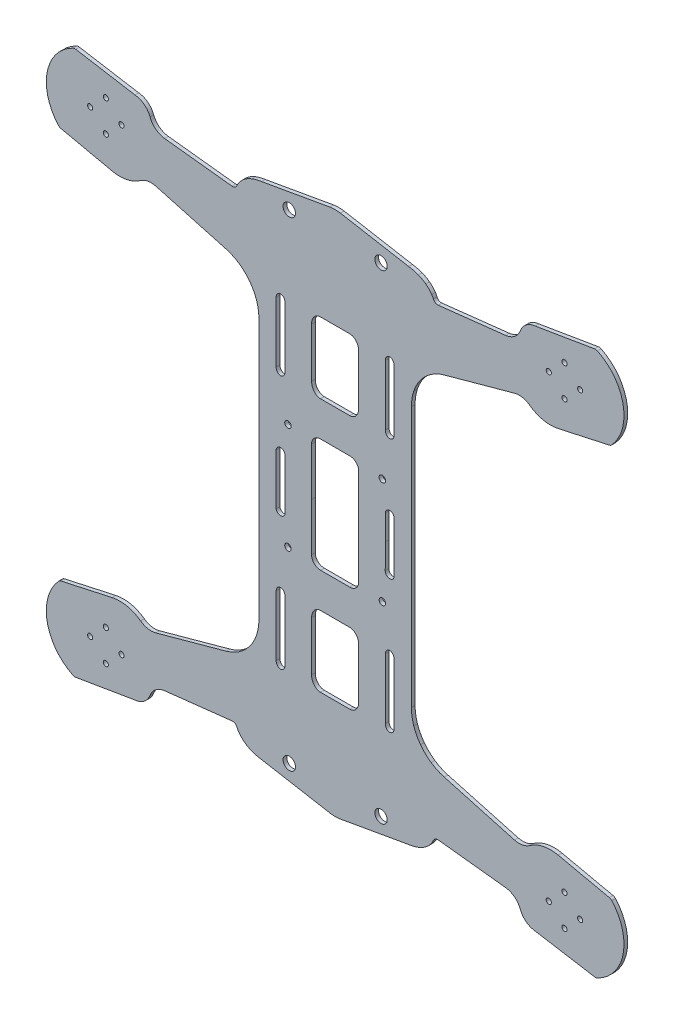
from build123d import *

# Parameters (mm, degrees)
SKETCH_1_R      = 0.7
SKETCH_1_R_2    = 0.88
SKETCH_1_R_3    = 1.68
EXTRUDE_3_DEPTH = 1


with BuildPart() as part:
    # Sketch 1 → Extrude 3 (new body)
    with BuildSketch(Plane.XY):
        with BuildLine():
            Line((-48.605903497, 52.42990912), (-29.552181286, 47.184893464))
            ThreePointArc((-29.552181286, 47.184893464), (-27.709376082, 46.512057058), (-26.003698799, 45.542879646))
            ThreePointArc((-26.003698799, 45.542879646), (-24.45735188, 44.287113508), (-23.136879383, 42.795641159))
            ThreePointArc((-23.136879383, 42.795641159), (-22.07347309, 41.106610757), (-21.295423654, 39.268596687))
            ThreePointArc((-21.295423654, 39.268596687), (-20.816727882, 37.310621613), (-20.655794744, 35.301413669))
            Line((-20.655794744, 35.301413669), (-20.655794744, 0))
            Line((-20.655794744, 0), (-20.655794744, -35.301413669))
            ThreePointArc((-20.655794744, -35.301413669), (-20.816727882, -37.310621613), (-21.295423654, -39.268596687))
            ThreePointArc((-21.295423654, -39.268596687), (-22.07347309, -41.106610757), (-23.136879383, -42.795641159))
            ThreePointArc((-23.136879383, -42.795641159), (-24.45735188, -44.287113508), (-26.003698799, -45.542879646))
            ThreePointArc((-26.003698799, -45.542879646), (-27.709376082, -46.512057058), (-29.552181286, -47.184893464))
            Line((-29.552181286, -47.184893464), (-48.605903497, -52.42990912))
            ThreePointArc((-48.605903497, -52.42990912), (-50.74444832, -52.523536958), (-52.711041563, -51.678166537))
            ThreePointArc((-52.711041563, -51.678166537), (-56.39626267, -50.036215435), (-60.430684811, -50.053420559))
            Line((-60.430684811, -50.053420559), (-74.301498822, -53.096569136))
            ThreePointArc((-74.301498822, -53.096569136), (-74.669635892, -53.239730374), (-74.976595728, -53.488317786))
            ThreePointArc((-74.976595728, -53.488317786), (-78.047331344, -64.51655366), (-71.067896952, -73.590632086))
            ThreePointArc((-71.067896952, -73.590632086), (-70.691456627, -73.70589884), (-70.297790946, -73.701308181))
            Line((-70.297790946, -73.701308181), (-54.257779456, -71.012953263))
            ThreePointArc((-54.257779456, -71.012953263), (-51.772055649, -70.04829217), (-50.18461337, -67.905998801))
            ThreePointArc((-50.18461337, -67.905998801), (-48.64108621, -65.797606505), (-46.221843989, -64.810154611))
            Line((-46.221843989, -64.810154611), (-27.944793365, -62.757117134))
            ThreePointArc((-27.944793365, -62.757117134), (-27.149749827, -62.92771579), (-26.6178947, -63.542799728))
            ThreePointArc((-26.6178947, -63.542799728), (-26.409980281, -63.983605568), (-26.158262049, -64.400949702))
            ThreePointArc((-26.158262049, -64.400949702), (-25.439899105, -65.2939236), (-24.582749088, -66.054674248))
            ThreePointArc((-24.582749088, -66.054674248), (-23.598902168, -66.689727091), (-22.537081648, -67.183472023))
            ThreePointArc((-22.537081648, -67.183472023), (-21.257763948, -67.587887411), (-19.939177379, -67.83594999))
            Line((-19.939177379, -67.83594999), (-1.346179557, -71.124325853))
            ThreePointArc((-1.346179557, -71.124325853), (-0.675075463, -71.201897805), (0, -71.227805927))
            ThreePointArc((0, -71.227805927), (0.675075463, -71.201897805), (1.346179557, -71.124325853))
            Line((1.346179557, -71.124325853), (19.939177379, -67.83594999))
            ThreePointArc((19.939177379, -67.83594999), (21.257763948, -67.587887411), (22.537081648, -67.183472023))
            ThreePointArc((22.537081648, -67.183472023), (23.598902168, -66.689727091), (24.582749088, -66.054674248))
            ThreePointArc((24.582749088, -66.054674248), (25.439899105, -65.2939236), (26.158262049, -64.400949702))
            ThreePointArc((26.158262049, -64.400949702), (26.409980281, -63.983605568), (26.6178947, -63.542799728))
            ThreePointArc((26.6178947, -63.542799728), (27.149749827, -62.92771579), (27.944793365, -62.757117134))
            Line((27.944793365, -62.757117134), (46.221843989, -64.810154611))
            ThreePointArc((46.221843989, -64.810154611), (48.64108621, -65.797606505), (50.18461337, -67.905998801))
            ThreePointArc((50.18461337, -67.905998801), (51.772055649, -70.04829217), (54.257779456, -71.012953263))
            Line((54.257779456, -71.012953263), (70.297790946, -73.701308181))
            ThreePointArc((70.297790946, -73.701308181), (70.691456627, -73.70589884), (71.067896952, -73.590632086))
            ThreePointArc((71.067896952, -73.590632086), (78.047331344, -64.51655366), (74.976595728, -53.488317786))
            ThreePointArc((74.976595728, -53.488317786), (74.669635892, -53.239730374), (74.301498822, -53.096569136))
            Line((74.301498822, -53.096569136), (60.430684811, -50.053420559))
            ThreePointArc((60.430684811, -50.053420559), (56.39626267, -50.036215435), (52.711041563, -51.678166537))
            ThreePointArc((52.711041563, -51.678166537), (50.74444832, -52.523536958), (48.605903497, -52.42990912))
            Line((48.605903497, -52.42990912), (29.552181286, -47.184893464))
            ThreePointArc((29.552181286, -47.184893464), (27.709376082, -46.512057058), (26.003698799, -45.542879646))
            ThreePointArc((26.003698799, -45.542879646), (24.45735188, -44.287113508), (23.136879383, -42.795641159))
            ThreePointArc((23.136879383, -42.795641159), (22.07347309, -41.106610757), (21.295423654, -39.268596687))
            ThreePointArc((21.295423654, -39.268596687), (20.816727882, -37.310621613), (20.655794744, -35.301413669))
            Line((20.655794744, -35.301413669), (20.655794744, 0))
            Line((20.655794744, 0), (20.655794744, 35.301413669))
            ThreePointArc((20.655794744, 35.301413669), (20.816727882, 37.310621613), (21.295423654, 39.268596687))
            ThreePointArc((21.295423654, 39.268596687), (22.07347309, 41.106610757), (23.136879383, 42.795641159))
            ThreePointArc((23.136879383, 42.795641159), (24.45735188, 44.287113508), (26.003698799, 45.542879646))
            ThreePointArc((26.003698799, 45.542879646), (27.709376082, 46.512057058), (29.552181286, 47.184893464))
            Line((29.552181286, 47.184893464), (48.605903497, 52.42990912))
            ThreePointArc((48.605903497, 52.42990912), (50.74444832, 52.523536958), (52.711041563, 51.678166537))
            ThreePointArc((52.711041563, 51.678166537), (56.39626267, 50.036215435), (60.430684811, 50.053420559))
            Line((60.430684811, 50.053420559), (74.301498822, 53.096569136))
            ThreePointArc((74.301498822, 53.096569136), (74.669635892, 53.239730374), (74.976595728, 53.488317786))
            ThreePointArc((74.976595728, 53.488317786), (78.047331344, 64.51655366), (71.067896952, 73.590632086))
            ThreePointArc((71.067896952, 73.590632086), (70.691456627, 73.70589884), (70.297790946, 73.701308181))
            Line((70.297790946, 73.701308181), (54.257779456, 71.012953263))
            ThreePointArc((54.257779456, 71.012953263), (51.772055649, 70.04829217), (50.18461337, 67.905998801))
            ThreePointArc((50.18461337, 67.905998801), (48.64108621, 65.797606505), (46.221843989, 64.810154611))
            Line((46.221843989, 64.810154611), (27.944793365, 62.757117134))
            ThreePointArc((27.944793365, 62.757117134), (27.149749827, 62.92771579), (26.6178947, 63.542799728))
            ThreePointArc((26.6178947, 63.542799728), (26.409980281, 63.983605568), (26.158262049, 64.400949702))
            ThreePointArc((26.158262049, 64.400949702), (25.439899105, 65.2939236), (24.582749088, 66.054674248))
            ThreePointArc((24.582749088, 66.054674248), (23.598902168, 66.689727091), (22.537081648, 67.183472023))
            ThreePointArc((22.537081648, 67.183472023), (21.257763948, 67.587887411), (19.939177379, 67.83594999))
            Line((19.939177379, 67.83594999), (1.43574764, 71.108484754))
            ThreePointArc((1.43574764, 71.108484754), (0.720287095, 71.196804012), (0, 71.226309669))
            ThreePointArc((0, 71.226309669), (-0.720287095, 71.196804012), (-1.43574764, 71.108484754))
            Line((-1.43574764, 71.108484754), (-19.939177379, 67.83594999))
            ThreePointArc((-19.939177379, 67.83594999), (-21.257763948, 67.587887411), (-22.537081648, 67.183472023))
            ThreePointArc((-22.537081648, 67.183472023), (-23.598902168, 66.689727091), (-24.582749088, 66.054674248))
            ThreePointArc((-24.582749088, 66.054674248), (-25.439899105, 65.2939236), (-26.158262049, 64.400949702))
            ThreePointArc((-26.158262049, 64.400949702), (-26.409980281, 63.983605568), (-26.6178947, 63.542799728))
            ThreePointArc((-26.6178947, 63.542799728), (-27.149749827, 62.92771579), (-27.944793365, 62.757117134))
            Line((-27.944793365, 62.757117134), (-46.221843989, 64.810154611))
            ThreePointArc((-46.221843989, 64.810154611), (-48.64108621, 65.797606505), (-50.18461337, 67.905998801))
            ThreePointArc((-50.18461337, 67.905998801), (-51.772055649, 70.04829217), (-54.257779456, 71.012953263))
            Line((-54.257779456, 71.012953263), (-70.297790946, 73.701308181))
            ThreePointArc((-70.297790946, 73.701308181), (-70.691456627, 73.70589884), (-71.067896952, 73.590632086))
            ThreePointArc((-71.067896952, 73.590632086), (-78.047331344, 64.51655366), (-74.976595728, 53.488317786))
            ThreePointArc((-74.976595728, 53.488317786), (-74.669635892, 53.239730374), (-74.301498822, 53.096569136))
            Line((-74.301498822, 53.096569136), (-60.430684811, 50.053420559))
            ThreePointArc((-60.430684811, 50.053420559), (-56.39626267, 50.036215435), (-52.711041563, 51.678166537))
            ThreePointArc((-52.711041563, 51.678166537), (-50.74444832, 52.523536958), (-48.605903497, 52.42990912))
        make_face()
        with Locations((62.149743, 66.398167)):
            Circle(SKETCH_1_R, mode=Mode.SUBTRACT)
        with Locations((12.792, 14.401562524)):
            Circle(SKETCH_1_R_2, mode=Mode.SUBTRACT)
        with Locations((66.399637, 62.150175)):
            Circle(SKETCH_1_R, mode=Mode.SUBTRACT)
        with Locations((57.897864, 62.149499)):
            Circle(SKETCH_1_R, mode=Mode.SUBTRACT)
        with Locations((12.437009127, 64.958952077)):
            Circle(SKETCH_1_R_3, mode=Mode.SUBTRACT)
        with Locations((62.149828, 57.899965)):
            Circle(SKETCH_1_R, mode=Mode.SUBTRACT)
        with Locations(Location((62.149828, -57.899965, 0), (0, 0, 180))):
            Circle(SKETCH_1_R, mode=Mode.SUBTRACT)
        with Locations(Location((12.437009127, -64.958952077, 0), (0, 0, 180))):
            Circle(SKETCH_1_R_3, mode=Mode.SUBTRACT)
        with Locations(Location((57.897864, -62.149499, 0), (0, 0, 180))):
            Circle(SKETCH_1_R, mode=Mode.SUBTRACT)
        with Locations(Location((66.399637, -62.150175, 0), (0, 0, 180))):
            Circle(SKETCH_1_R, mode=Mode.SUBTRACT)
        with Locations(Location((12.792, -14.401562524, 0), (0, 0, 180))):
            Circle(SKETCH_1_R_2, mode=Mode.SUBTRACT)
        with Locations(Location((62.149743, -66.398167, 0), (0, 0, 180))):
            Circle(SKETCH_1_R, mode=Mode.SUBTRACT)
        with Locations((-62.149743, -66.398167)):
            Circle(SKETCH_1_R, mode=Mode.SUBTRACT)
        with Locations((-12.792, -14.401562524)):
            Circle(SKETCH_1_R_2, mode=Mode.SUBTRACT)
        with Locations((-66.399637, -62.150175)):
            Circle(SKETCH_1_R, mode=Mode.SUBTRACT)
        with Locations((-57.897864, -62.149499)):
            Circle(SKETCH_1_R, mode=Mode.SUBTRACT)
        with Locations((-12.437009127, -64.958952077)):
            Circle(SKETCH_1_R_3, mode=Mode.SUBTRACT)
        with Locations((-62.149828, -57.899965)):
            Circle(SKETCH_1_R, mode=Mode.SUBTRACT)
        with Locations(Location((-62.149828, 57.899965, 0), (0, 0, 180))):
            Circle(SKETCH_1_R, mode=Mode.SUBTRACT)
        with Locations(Location((-12.437009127, 64.958952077, 0), (0, 0, 180))):
            Circle(SKETCH_1_R_3, mode=Mode.SUBTRACT)
        with Locations(Location((-57.897864, 62.149499, 0), (0, 0, 180))):
            Circle(SKETCH_1_R, mode=Mode.SUBTRACT)
        with Locations(Location((-66.399637, 62.150175, 0), (0, 0, 180))):
            Circle(SKETCH_1_R, mode=Mode.SUBTRACT)
        with Locations(Location((-12.792, 14.401562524, 0), (0, 0, 180))):
            Circle(SKETCH_1_R_2, mode=Mode.SUBTRACT)
        with Locations(Location((-62.149743, 66.398167, 0), (0, 0, 180))):
            Circle(SKETCH_1_R, mode=Mode.SUBTRACT)
        with BuildLine():
            Line((-15.992, 0), (-15.992, -7.014435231))
            ThreePointArc((-15.992, -7.014435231), (-14.650041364, -8.012001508), (-13.575309, -6.731009))
            Line((-13.575309, -6.731009), (-13.592, 0))
            Line((-13.592, 0), (-13.592, 6.801562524))
            ThreePointArc((-13.592, 6.801562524), (-14.792, 8.001562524), (-15.992, 6.801562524))
            Line((-15.992, 6.801562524), (-15.992, 0))
        make_face(mode=Mode.SUBTRACT)
        with BuildLine():
            Line((15.992, 6.801562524), (15.992, 0))
            Line((15.992, 0), (15.992, -7.014435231))
            ThreePointArc((15.992, -7.014435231), (14.650041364, -8.012001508), (13.575309, -6.731009))
            Line((13.575309, -6.731009), (13.592, 0))
            Line((13.592, 0), (13.592, 6.801562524))
            ThreePointArc((13.592, 6.801562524), (14.792, 8.001562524), (15.992, 6.801562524))
        make_face(mode=Mode.SUBTRACT)
        with BuildLine():
            Line((15.992, 42.610628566), (15.992, 26.290628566))
            add(Edge.make_bspline(
                [(13.592, 26.290628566), (13.592, 24.850628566), (14.792, 24.850628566), (15.992, 24.850628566), (15.992, 26.290628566)],
                knots=[1.570796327, 1.570796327, 1.570796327, 3.141592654, 3.141592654, 4.71238898, 4.71238898, 4.71238898], degree=2, weights=[1, 0.707106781, 1, 0.707106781, 1]))
            Line((13.592, 26.290628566), (13.592, 42.610628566))
            add(Edge.make_bspline(
                [(15.992, 42.610628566), (15.992, 44.050628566), (14.792, 44.050628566), (13.592, 44.050628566), (13.592, 42.610628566)],
                knots=[4.71238898, 4.71238898, 4.71238898, 6.283185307, 6.283185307, 7.853981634, 7.853981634, 7.853981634], degree=2, weights=[1, 0.707106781, 1, 0.707106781, 1]))
        make_face(mode=Mode.SUBTRACT)
        with BuildLine():
            Line((-6.392, 0), (-6.392314, -13.002299))
            ThreePointArc((-6.392314, -13.002299), (-5.675231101, -14.712772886), (-3.953169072, -15.401562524))
            Line((-3.953169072, -15.401562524), (3.953169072, -15.401562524))
            ThreePointArc((3.953169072, -15.401562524), (5.675231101, -14.712772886), (6.392314, -13.002299))
            Line((6.392314, -13.002299), (6.392, 0))
            Line((6.392, 0), (6.392, 13.001562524))
            ThreePointArc((6.392, 13.001562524), (5.689056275, 14.698618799), (3.992, 15.401562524))
            Line((3.992, 15.401562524), (-3.992, 15.401562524))
            ThreePointArc((-3.992, 15.401562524), (-5.689056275, 14.698618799), (-6.392, 13.001562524))
            Line((-6.392, 13.001562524), (-6.392, 0))
        make_face(mode=Mode.SUBTRACT)
        with BuildLine():
            Line((6.392, -41.170628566), (6.392, -27.730628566))
            add(Edge.make_bspline(
                [(6.392, -27.730628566), (6.392, -24.850628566), (3.992, -24.850628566)],
                knots=[4.71238898, 4.71238898, 4.71238898, 6.283185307, 6.283185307, 6.283185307], degree=2, weights=[1, 0.707106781, 1]))
            Line((3.992, -24.850628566), (-3.992, -24.850628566))
            add(Edge.make_bspline(
                [(-3.992, -24.850628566), (-6.392, -24.850628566), (-6.392, -27.730628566)],
                knots=[0, 0, 0, 1.570796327, 1.570796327, 1.570796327], degree=2, weights=[1, 0.707106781, 1]))
            Line((-6.392, -27.730628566), (-6.392, -41.170628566))
            add(Edge.make_bspline(
                [(-6.392, -41.170628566), (-6.392, -44.050628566), (-3.992, -44.050628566)],
                knots=[1.570796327, 1.570796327, 1.570796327, 3.141592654, 3.141592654, 3.141592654], degree=2, weights=[1, 0.707106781, 1]))
            Line((-3.992, -44.050628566), (3.992, -44.050628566))
            add(Edge.make_bspline(
                [(3.992, -44.050628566), (6.392, -44.050628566), (6.392, -41.170628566)],
                knots=[3.141592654, 3.141592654, 3.141592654, 4.71238898, 4.71238898, 4.71238898], degree=2, weights=[1, 0.707106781, 1]))
        make_face(mode=Mode.SUBTRACT)
        with BuildLine():
            Line((-3.992, 24.850628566), (3.992, 24.850628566))
            add(Edge.make_bspline(
                [(3.992, 24.850628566), (6.392, 24.850628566), (6.392, 27.730628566)],
                knots=[0, 0, 0, 1.570796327, 1.570796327, 1.570796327], degree=2, weights=[1, 0.707106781, 1]))
            Line((6.392, 27.730628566), (6.392, 41.170628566))
            add(Edge.make_bspline(
                [(6.392, 41.170628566), (6.392, 44.050628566), (3.992, 44.050628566)],
                knots=[4.71238898, 4.71238898, 4.71238898, 6.283185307, 6.283185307, 6.283185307], degree=2, weights=[1, 0.707106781, 1]))
            Line((3.992, 44.050628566), (-3.992, 44.050628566))
            add(Edge.make_bspline(
                [(-3.992, 44.050628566), (-6.392, 44.050628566), (-6.392, 41.170628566)],
                knots=[3.141592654, 3.141592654, 3.141592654, 4.71238898, 4.71238898, 4.71238898], degree=2, weights=[1, 0.707106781, 1]))
            Line((-6.392, 41.170628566), (-6.392, 27.730628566))
            add(Edge.make_bspline(
                [(-6.392, 27.730628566), (-6.392, 24.850628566), (-3.992, 24.850628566)],
                knots=[4.71238898, 4.71238898, 4.71238898, 6.283185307, 6.283185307, 6.283185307], degree=2, weights=[1, 0.707106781, 1]))
        make_face(mode=Mode.SUBTRACT)
        with BuildLine():
            Line((13.592, -26.290628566), (13.592, -42.610628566))
            add(Edge.make_bspline(
                [(13.592, -42.610628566), (13.592, -44.050628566), (14.792, -44.050628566), (15.992, -44.050628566), (15.992, -42.610628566)],
                knots=[1.570796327, 1.570796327, 1.570796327, 3.141592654, 3.141592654, 4.71238898, 4.71238898, 4.71238898], degree=2, weights=[1, 0.707106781, 1, 0.707106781, 1]))
            Line((15.992, -42.610628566), (15.992, -26.290628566))
            add(Edge.make_bspline(
                [(15.992, -26.290628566), (15.992, -24.850628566), (14.792, -24.850628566), (13.592, -24.850628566), (13.592, -26.290628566)],
                knots=[4.71238898, 4.71238898, 4.71238898, 6.283185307, 6.283185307, 7.853981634, 7.853981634, 7.853981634], degree=2, weights=[1, 0.707106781, 1, 0.707106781, 1]))
        make_face(mode=Mode.SUBTRACT)
        with BuildLine():
            Line((-15.992, -42.610628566), (-15.992, -26.290628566))
            add(Edge.make_bspline(
                [(-13.592, -26.290628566), (-13.592, -24.850628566), (-14.792, -24.850628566), (-15.992, -24.850628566), (-15.992, -26.290628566)],
                knots=[4.71238898, 4.71238898, 4.71238898, 6.283185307, 6.283185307, 7.853981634, 7.853981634, 7.853981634], degree=2, weights=[1, 0.707106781, 1, 0.707106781, 1]))
            Line((-13.592, -26.290628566), (-13.592, -42.610628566))
            add(Edge.make_bspline(
                [(-15.992, -42.610628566), (-15.992, -44.050628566), (-14.792, -44.050628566), (-13.592, -44.050628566), (-13.592, -42.610628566)],
                knots=[1.570796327, 1.570796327, 1.570796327, 3.141592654, 3.141592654, 4.71238898, 4.71238898, 4.71238898], degree=2, weights=[1, 0.707106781, 1, 0.707106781, 1]))
        make_face(mode=Mode.SUBTRACT)
        with BuildLine():
            Line((-13.592, 26.290628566), (-13.592, 42.610628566))
            add(Edge.make_bspline(
                [(-13.592, 42.610628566), (-13.592, 44.050628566), (-14.792, 44.050628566), (-15.992, 44.050628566), (-15.992, 42.610628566)],
                knots=[1.570796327, 1.570796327, 1.570796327, 3.141592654, 3.141592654, 4.71238898, 4.71238898, 4.71238898], degree=2, weights=[1, 0.707106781, 1, 0.707106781, 1]))
            Line((-15.992, 42.610628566), (-15.992, 26.290628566))
            add(Edge.make_bspline(
                [(-15.992, 26.290628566), (-15.992, 24.850628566), (-14.792, 24.850628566), (-13.592, 24.850628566), (-13.592, 26.290628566)],
                knots=[4.71238898, 4.71238898, 4.71238898, 6.283185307, 6.283185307, 7.853981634, 7.853981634, 7.853981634], degree=2, weights=[1, 0.707106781, 1, 0.707106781, 1]))
        make_face(mode=Mode.SUBTRACT)
    extrude(amount=EXTRUDE_3_DEPTH)


solid = part.part
